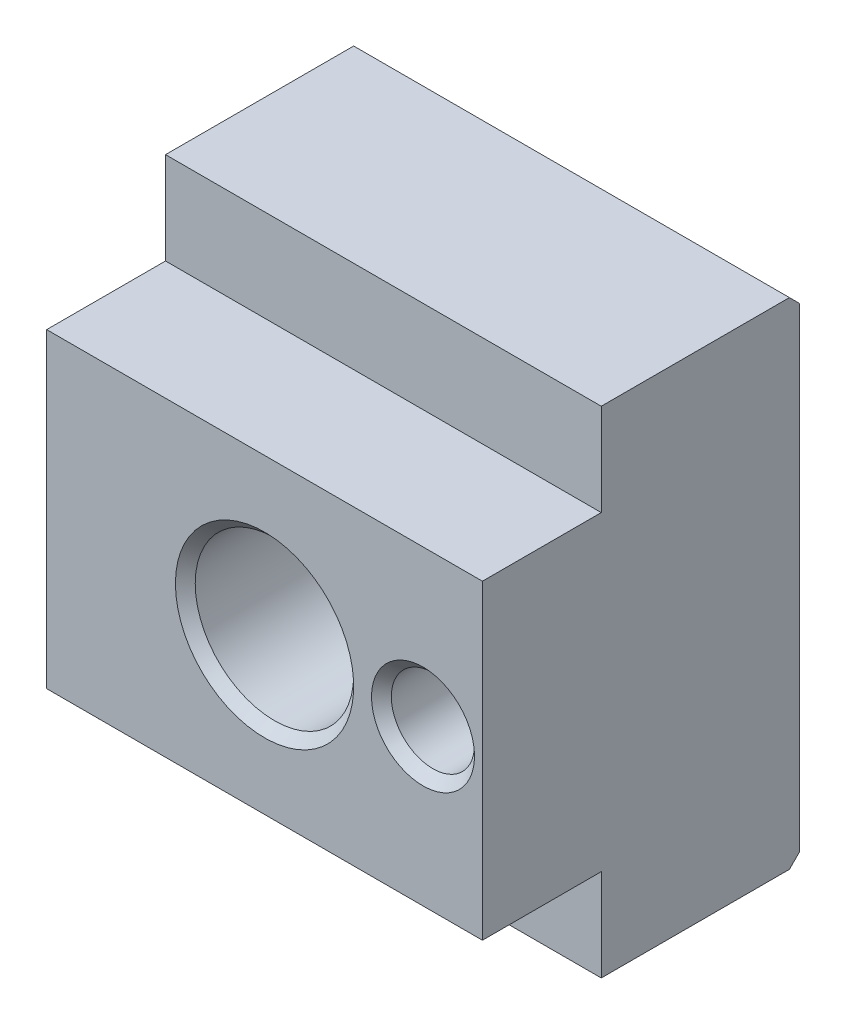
ISO-10303-21;
HEADER;
FILE_DESCRIPTION(('STEP AP214'),'2;1');
FILE_NAME('part.step','',(''),(''),'','','');
FILE_SCHEMA(('AUTOMOTIVE_DESIGN { 1 0 10303 214 1 1 1 1 }'));
ENDSEC;
DATA;
#1=APPLICATION_CONTEXT('core data for automotive mechanical design processes');
#2=APPLICATION_PROTOCOL_DEFINITION('international standard','automotive_design',2000,#1);
#3=PRODUCT_CONTEXT('',#1,'mechanical');
#4=PRODUCT('Part','Part','',(#3));
#5=PRODUCT_RELATED_PRODUCT_CATEGORY('part','',(#4));
#6=PRODUCT_DEFINITION_FORMATION('','',#4);
#7=PRODUCT_DEFINITION_CONTEXT('part definition',#1,'design');
#8=PRODUCT_DEFINITION('design','',#6,#7);
#9=PRODUCT_DEFINITION_SHAPE('','',#8);
#10=(LENGTH_UNIT() NAMED_UNIT(*) SI_UNIT(.MILLI.,.METRE.));
#11=(NAMED_UNIT(*) PLANE_ANGLE_UNIT() SI_UNIT($,.RADIAN.));
#12=(NAMED_UNIT(*) SI_UNIT($,.STERADIAN.) SOLID_ANGLE_UNIT());
#13=UNCERTAINTY_MEASURE_WITH_UNIT(LENGTH_MEASURE(1.E-05),#10,'distance_accuracy_value','');
#14=(GEOMETRIC_REPRESENTATION_CONTEXT(3) GLOBAL_UNCERTAINTY_ASSIGNED_CONTEXT((#13)) GLOBAL_UNIT_ASSIGNED_CONTEXT((#10,
#11,#12)) REPRESENTATION_CONTEXT('',''));
#15=CARTESIAN_POINT('',(0.,0.,0.));
#16=DIRECTION('',(0.,0.,1.));
#17=DIRECTION('',(1.,0.,0.));
#18=AXIS2_PLACEMENT_3D('',#15,#16,#17);
#19=CARTESIAN_POINT('',(-11.05,-7.85,0.));
#20=DIRECTION('',(0.,0.,-1.));
#21=DIRECTION('',(-1.,0.,0.));
#22=AXIS2_PLACEMENT_3D('',#19,#20,#21);
#23=PLANE('',#22);
#24=DIRECTION('',(-1.,0.,0.));
#25=VECTOR('',#24,1.);
#26=CARTESIAN_POINT('',(-11.05,-12.5,0.));
#27=LINE('',#26,#25);
#28=CARTESIAN_POINT('',(-11.,-12.5,0.));
#29=VERTEX_POINT('',#28);
#30=CARTESIAN_POINT('',(11.,-12.5,0.));
#31=VERTEX_POINT('',#30);
#32=EDGE_CURVE('E211',#29,#31,#27,.F.);
#33=ORIENTED_EDGE('',*,*,#32,.T.);
#34=DIRECTION('',(0.,1.,0.));
#35=VECTOR('',#34,1.);
#36=CARTESIAN_POINT('',(11.,-7.85,0.));
#37=LINE('',#36,#35);
#38=CARTESIAN_POINT('',(11.,-7.85,0.));
#39=VERTEX_POINT('',#38);
#40=EDGE_CURVE('E212',#31,#39,#37,.T.);
#41=ORIENTED_EDGE('',*,*,#40,.T.);
#42=DIRECTION('',(1.,0.,0.));
#43=VECTOR('',#42,1.);
#44=CARTESIAN_POINT('',(-11.05,-7.85,0.));
#45=LINE('',#44,#43);
#46=CARTESIAN_POINT('',(-11.,-7.85,0.));
#47=VERTEX_POINT('',#46);
#48=EDGE_CURVE('E120',#39,#47,#45,.F.);
#49=ORIENTED_EDGE('',*,*,#48,.T.);
#50=DIRECTION('',(0.,-1.,0.));
#51=VECTOR('',#50,1.);
#52=CARTESIAN_POINT('',(-11.,-7.85,0.));
#53=LINE('',#52,#51);
#54=EDGE_CURVE('E215',#47,#29,#53,.T.);
#55=ORIENTED_EDGE('',*,*,#54,.T.);
#56=EDGE_LOOP('',(#33,#41,#49,#55));
#57=FACE_BOUND('',#56,.T.);
#58=ADVANCED_FACE('F14',(#57),#23,.F.);
#59=CARTESIAN_POINT('',(-11.05,-7.85,6.));
#60=DIRECTION('',(0.,1.,0.));
#61=DIRECTION('',(1.,0.,0.));
#62=AXIS2_PLACEMENT_3D('',#59,#60,#61);
#63=PLANE('',#62);
#64=ORIENTED_EDGE('',*,*,#48,.F.);
#65=DIRECTION('',(0.,0.,1.));
#66=VECTOR('',#65,1.);
#67=CARTESIAN_POINT('',(11.,-7.85,6.));
#68=LINE('',#67,#66);
#69=CARTESIAN_POINT('',(11.,-7.85,6.));
#70=VERTEX_POINT('',#69);
#71=EDGE_CURVE('E253',#39,#70,#68,.T.);
#72=ORIENTED_EDGE('',*,*,#71,.T.);
#73=DIRECTION('',(-1.,0.,0.));
#74=VECTOR('',#73,1.);
#75=CARTESIAN_POINT('',(-11.05,-7.85,6.));
#76=LINE('',#75,#74);
#77=CARTESIAN_POINT('',(-11.,-7.85,6.));
#78=VERTEX_POINT('',#77);
#79=EDGE_CURVE('E109',#70,#78,#76,.T.);
#80=ORIENTED_EDGE('',*,*,#79,.T.);
#81=DIRECTION('',(0.,0.,-1.));
#82=VECTOR('',#81,1.);
#83=CARTESIAN_POINT('',(-11.,-7.85,6.));
#84=LINE('',#83,#82);
#85=EDGE_CURVE('E237',#78,#47,#84,.T.);
#86=ORIENTED_EDGE('',*,*,#85,.T.);
#87=EDGE_LOOP('',(#64,#72,#80,#86));
#88=FACE_BOUND('',#87,.T.);
#89=ADVANCED_FACE('F197',(#88),#63,.F.);
#90=CARTESIAN_POINT('',(-11.05,-7.85,6.));
#91=DIRECTION('',(0.,0.,-1.));
#92=DIRECTION('',(-1.,0.,0.));
#93=AXIS2_PLACEMENT_3D('',#90,#91,#92);
#94=PLANE('',#93);
#95=CARTESIAN_POINT('',(0.,0.,6.));
#96=DIRECTION('',(0.,0.,-1.));
#97=DIRECTION('',(-1.,0.,0.));
#98=AXIS2_PLACEMENT_3D('',#95,#96,#97);
#99=CIRCLE('',#98,4.5);
#100=CARTESIAN_POINT('',(-4.5,0.,6.));
#101=VERTEX_POINT('',#100);
#102=EDGE_CURVE('E140',#101,#101,#99,.T.);
#103=ORIENTED_EDGE('',*,*,#102,.T.);
#104=EDGE_LOOP('',(#103));
#105=FACE_BOUND('',#104,.T.);
#106=CARTESIAN_POINT('',(8.,0.,6.));
#107=DIRECTION('',(0.,0.,-1.));
#108=DIRECTION('',(-1.,0.,0.));
#109=AXIS2_PLACEMENT_3D('',#106,#107,#108);
#110=CIRCLE('',#109,2.6);
#111=CARTESIAN_POINT('',(5.4,0.,6.));
#112=VERTEX_POINT('',#111);
#113=EDGE_CURVE('E137',#112,#112,#110,.T.);
#114=ORIENTED_EDGE('',*,*,#113,.T.);
#115=EDGE_LOOP('',(#114));
#116=FACE_BOUND('',#115,.T.);
#117=ORIENTED_EDGE('',*,*,#79,.F.);
#118=DIRECTION('',(0.,-1.,0.));
#119=VECTOR('',#118,1.);
#120=CARTESIAN_POINT('',(11.,-14.2792774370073,6.));
#121=LINE('',#120,#119);
#122=CARTESIAN_POINT('',(11.,7.85,6.));
#123=VERTEX_POINT('',#122);
#124=EDGE_CURVE('E94',#123,#70,#121,.T.);
#125=ORIENTED_EDGE('',*,*,#124,.F.);
#126=DIRECTION('',(-1.,0.,0.));
#127=VECTOR('',#126,1.);
#128=CARTESIAN_POINT('',(-11.05,7.85,6.));
#129=LINE('',#128,#127);
#130=CARTESIAN_POINT('',(-11.,7.85,6.));
#131=VERTEX_POINT('',#130);
#132=EDGE_CURVE('E107',#123,#131,#129,.T.);
#133=ORIENTED_EDGE('',*,*,#132,.T.);
#134=DIRECTION('',(0.,1.,0.));
#135=VECTOR('',#134,1.);
#136=CARTESIAN_POINT('',(-11.,-14.2792774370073,6.));
#137=LINE('',#136,#135);
#138=EDGE_CURVE('E101',#78,#131,#137,.T.);
#139=ORIENTED_EDGE('',*,*,#138,.F.);
#140=EDGE_LOOP('',(#117,#125,#133,#139));
#141=FACE_BOUND('',#140,.T.);
#142=ADVANCED_FACE('F105',(#105,#116,#141),#94,.F.);
#143=CARTESIAN_POINT('',(-11.05,7.85,6.));
#144=DIRECTION('',(0.,-1.,0.));
#145=DIRECTION('',(-1.,0.,0.));
#146=AXIS2_PLACEMENT_3D('',#143,#144,#145);
#147=PLANE('',#146);
#148=ORIENTED_EDGE('',*,*,#132,.F.);
#149=DIRECTION('',(0.,0.,-1.));
#150=VECTOR('',#149,1.);
#151=CARTESIAN_POINT('',(11.,7.85,6.));
#152=LINE('',#151,#150);
#153=CARTESIAN_POINT('',(11.,7.85,0.));
#154=VERTEX_POINT('',#153);
#155=EDGE_CURVE('E91',#123,#154,#152,.T.);
#156=ORIENTED_EDGE('',*,*,#155,.T.);
#157=DIRECTION('',(-1.,0.,0.));
#158=VECTOR('',#157,1.);
#159=CARTESIAN_POINT('',(-11.05,7.85,0.));
#160=LINE('',#159,#158);
#161=CARTESIAN_POINT('',(-11.,7.85,0.));
#162=VERTEX_POINT('',#161);
#163=EDGE_CURVE('E116',#154,#162,#160,.T.);
#164=ORIENTED_EDGE('',*,*,#163,.T.);
#165=DIRECTION('',(0.,0.,1.));
#166=VECTOR('',#165,1.);
#167=CARTESIAN_POINT('',(-11.,7.85,6.));
#168=LINE('',#167,#166);
#169=EDGE_CURVE('E115',#162,#131,#168,.T.);
#170=ORIENTED_EDGE('',*,*,#169,.T.);
#171=EDGE_LOOP('',(#148,#156,#164,#170));
#172=FACE_BOUND('',#171,.T.);
#173=ADVANCED_FACE('F113',(#172),#147,.F.);
#174=CARTESIAN_POINT('',(-11.05,12.5,0.));
#175=DIRECTION('',(0.,0.,-1.));
#176=DIRECTION('',(0.,-1.,0.));
#177=AXIS2_PLACEMENT_3D('',#174,#175,#176);
#178=PLANE('',#177);
#179=ORIENTED_EDGE('',*,*,#163,.F.);
#180=DIRECTION('',(0.,1.,0.));
#181=VECTOR('',#180,1.);
#182=CARTESIAN_POINT('',(11.,12.5,0.));
#183=LINE('',#182,#181);
#184=CARTESIAN_POINT('',(11.,12.5,0.));
#185=VERTEX_POINT('',#184);
#186=EDGE_CURVE('E97',#154,#185,#183,.T.);
#187=ORIENTED_EDGE('',*,*,#186,.T.);
#188=DIRECTION('',(-1.,0.,0.));
#189=VECTOR('',#188,1.);
#190=CARTESIAN_POINT('',(-11.05,12.5,0.));
#191=LINE('',#190,#189);
#192=CARTESIAN_POINT('',(-11.,12.5,0.));
#193=VERTEX_POINT('',#192);
#194=EDGE_CURVE('E118',#185,#193,#191,.T.);
#195=ORIENTED_EDGE('',*,*,#194,.T.);
#196=DIRECTION('',(0.,-1.,0.));
#197=VECTOR('',#196,1.);
#198=CARTESIAN_POINT('',(-11.,12.5,0.));
#199=LINE('',#198,#197);
#200=EDGE_CURVE('E229',#193,#162,#199,.T.);
#201=ORIENTED_EDGE('',*,*,#200,.T.);
#202=EDGE_LOOP('',(#179,#187,#195,#201));
#203=FACE_BOUND('',#202,.T.);
#204=ADVANCED_FACE('F188',(#203),#178,.F.);
#205=CARTESIAN_POINT('',(-11.05,12.5,0.));
#206=DIRECTION('',(0.,-1.,0.));
#207=DIRECTION('',(-1.,0.,0.));
#208=AXIS2_PLACEMENT_3D('',#205,#206,#207);
#209=PLANE('',#208);
#210=ORIENTED_EDGE('',*,*,#194,.F.);
#211=DIRECTION('',(0.,0.,-1.));
#212=VECTOR('',#211,1.);
#213=CARTESIAN_POINT('',(11.,12.5,0.));
#214=LINE('',#213,#212);
#215=CARTESIAN_POINT('',(11.,12.5,-9.5));
#216=VERTEX_POINT('',#215);
#217=EDGE_CURVE('E248',#185,#216,#214,.T.);
#218=ORIENTED_EDGE('',*,*,#217,.T.);
#219=DIRECTION('',(-1.,0.,0.));
#220=VECTOR('',#219,1.);
#221=CARTESIAN_POINT('',(-11.05,12.5,-9.5));
#222=LINE('',#221,#220);
#223=CARTESIAN_POINT('',(-11.,12.5,-9.5));
#224=VERTEX_POINT('',#223);
#225=EDGE_CURVE('E218',#216,#224,#222,.T.);
#226=ORIENTED_EDGE('',*,*,#225,.T.);
#227=DIRECTION('',(0.,0.,1.));
#228=VECTOR('',#227,1.);
#229=CARTESIAN_POINT('',(-11.,12.5,0.));
#230=LINE('',#229,#228);
#231=EDGE_CURVE('E232',#224,#193,#230,.T.);
#232=ORIENTED_EDGE('',*,*,#231,.T.);
#233=EDGE_LOOP('',(#210,#218,#226,#232));
#234=FACE_BOUND('',#233,.T.);
#235=ADVANCED_FACE('F184',(#234),#209,.F.);
#236=CARTESIAN_POINT('',(-11.05,-12.5,0.));
#237=DIRECTION('',(0.,1.,0.));
#238=DIRECTION('',(0.,0.,-1.));
#239=AXIS2_PLACEMENT_3D('',#236,#237,#238);
#240=PLANE('',#239);
#241=DIRECTION('',(-1.,0.,0.));
#242=VECTOR('',#241,1.);
#243=CARTESIAN_POINT('',(-11.05,-12.5,-9.5));
#244=LINE('',#243,#242);
#245=CARTESIAN_POINT('',(-11.,-12.5,-9.5));
#246=VERTEX_POINT('',#245);
#247=CARTESIAN_POINT('',(11.,-12.5,-9.5));
#248=VERTEX_POINT('',#247);
#249=EDGE_CURVE('E220',#246,#248,#244,.F.);
#250=ORIENTED_EDGE('',*,*,#249,.T.);
#251=DIRECTION('',(0.,0.,1.));
#252=VECTOR('',#251,1.);
#253=CARTESIAN_POINT('',(11.,-12.5,0.));
#254=LINE('',#253,#252);
#255=EDGE_CURVE('E256',#248,#31,#254,.T.);
#256=ORIENTED_EDGE('',*,*,#255,.T.);
#257=ORIENTED_EDGE('',*,*,#32,.F.);
#258=DIRECTION('',(0.,0.,-1.));
#259=VECTOR('',#258,1.);
#260=CARTESIAN_POINT('',(-11.,-12.5,0.));
#261=LINE('',#260,#259);
#262=EDGE_CURVE('E241',#29,#246,#261,.T.);
#263=ORIENTED_EDGE('',*,*,#262,.T.);
#264=EDGE_LOOP('',(#250,#256,#257,#263));
#265=FACE_BOUND('',#264,.T.);
#266=ADVANCED_FACE('F181',(#265),#240,.F.);
#267=CARTESIAN_POINT('',(-11.05,12.,-10.));
#268=DIRECTION('',(0.,-0.707106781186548,0.707106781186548));
#269=DIRECTION('',(0.,0.707106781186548,0.707106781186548));
#270=AXIS2_PLACEMENT_3D('',#267,#268,#269);
#271=PLANE('',#270);
#272=ORIENTED_EDGE('',*,*,#225,.F.);
#273=DIRECTION('',(0.,-0.707106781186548,-0.707106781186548));
#274=VECTOR('',#273,1.);
#275=CARTESIAN_POINT('',(11.,12.,-10.));
#276=LINE('',#275,#274);
#277=CARTESIAN_POINT('',(11.,12.,-10.));
#278=VERTEX_POINT('',#277);
#279=EDGE_CURVE('E251',#216,#278,#276,.T.);
#280=ORIENTED_EDGE('',*,*,#279,.T.);
#281=DIRECTION('',(1.,0.,0.));
#282=VECTOR('',#281,1.);
#283=CARTESIAN_POINT('',(-11.05,12.,-10.));
#284=LINE('',#283,#282);
#285=CARTESIAN_POINT('',(-11.,12.,-10.));
#286=VERTEX_POINT('',#285);
#287=EDGE_CURVE('E37',#278,#286,#284,.F.);
#288=ORIENTED_EDGE('',*,*,#287,.T.);
#289=DIRECTION('',(0.,0.707106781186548,0.707106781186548));
#290=VECTOR('',#289,1.);
#291=CARTESIAN_POINT('',(-11.,12.,-10.));
#292=LINE('',#291,#290);
#293=EDGE_CURVE('E235',#286,#224,#292,.T.);
#294=ORIENTED_EDGE('',*,*,#293,.T.);
#295=EDGE_LOOP('',(#272,#280,#288,#294));
#296=FACE_BOUND('',#295,.T.);
#297=ADVANCED_FACE('F174',(#296),#271,.F.);
#298=CARTESIAN_POINT('',(-11.05,-12.5,-9.5));
#299=DIRECTION('',(0.,0.707106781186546,0.707106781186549));
#300=DIRECTION('',(0.,0.707106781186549,-0.707106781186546));
#301=AXIS2_PLACEMENT_3D('',#298,#299,#300);
#302=PLANE('',#301);
#303=DIRECTION('',(1.,0.,0.));
#304=VECTOR('',#303,1.);
#305=CARTESIAN_POINT('',(-11.05,-12.,-10.));
#306=LINE('',#305,#304);
#307=CARTESIAN_POINT('',(-11.,-12.,-10.));
#308=VERTEX_POINT('',#307);
#309=CARTESIAN_POINT('',(11.,-12.,-10.));
#310=VERTEX_POINT('',#309);
#311=EDGE_CURVE('E129',#308,#310,#306,.T.);
#312=ORIENTED_EDGE('',*,*,#311,.T.);
#313=DIRECTION('',(0.,-0.707106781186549,0.707106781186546));
#314=VECTOR('',#313,1.);
#315=CARTESIAN_POINT('',(11.,-12.5,-9.5));
#316=LINE('',#315,#314);
#317=EDGE_CURVE('E29',#310,#248,#316,.T.);
#318=ORIENTED_EDGE('',*,*,#317,.T.);
#319=ORIENTED_EDGE('',*,*,#249,.F.);
#320=DIRECTION('',(0.,0.707106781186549,-0.707106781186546));
#321=VECTOR('',#320,1.);
#322=CARTESIAN_POINT('',(-11.,-12.5,-9.5));
#323=LINE('',#322,#321);
#324=EDGE_CURVE('E243',#246,#308,#323,.T.);
#325=ORIENTED_EDGE('',*,*,#324,.T.);
#326=EDGE_LOOP('',(#312,#318,#319,#325));
#327=FACE_BOUND('',#326,.T.);
#328=ADVANCED_FACE('F165',(#327),#302,.F.);
#329=CARTESIAN_POINT('',(-11.05,12.5,-10.));
#330=DIRECTION('',(0.,0.,1.));
#331=DIRECTION('',(1.,0.,0.));
#332=AXIS2_PLACEMENT_3D('',#329,#330,#331);
#333=PLANE('',#332);
#334=CARTESIAN_POINT('',(0.,0.,-10.));
#335=DIRECTION('',(0.,0.,1.));
#336=DIRECTION('',(1.,0.,0.));
#337=AXIS2_PLACEMENT_3D('',#334,#335,#336);
#338=CIRCLE('',#337,4.5);
#339=CARTESIAN_POINT('',(4.5,0.,-10.));
#340=VERTEX_POINT('',#339);
#341=EDGE_CURVE('E22',#340,#340,#338,.T.);
#342=ORIENTED_EDGE('',*,*,#341,.T.);
#343=EDGE_LOOP('',(#342));
#344=FACE_BOUND('',#343,.T.);
#345=ORIENTED_EDGE('',*,*,#287,.F.);
#346=DIRECTION('',(0.,-1.,0.));
#347=VECTOR('',#346,1.);
#348=CARTESIAN_POINT('',(11.,12.5,-10.));
#349=LINE('',#348,#347);
#350=EDGE_CURVE('E128',#278,#310,#349,.T.);
#351=ORIENTED_EDGE('',*,*,#350,.T.);
#352=ORIENTED_EDGE('',*,*,#311,.F.);
#353=DIRECTION('',(0.,1.,0.));
#354=VECTOR('',#353,1.);
#355=CARTESIAN_POINT('',(-11.,12.5,-10.));
#356=LINE('',#355,#354);
#357=EDGE_CURVE('E125',#308,#286,#356,.T.);
#358=ORIENTED_EDGE('',*,*,#357,.T.);
#359=EDGE_LOOP('',(#345,#351,#352,#358));
#360=FACE_BOUND('',#359,.T.);
#361=ADVANCED_FACE('F145',(#344,#360),#333,.F.);
#362=CARTESIAN_POINT('',(-11.,-14.2792774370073,-10.));
#363=DIRECTION('',(1.,0.,0.));
#364=DIRECTION('',(0.,-1.,0.));
#365=AXIS2_PLACEMENT_3D('',#362,#363,#364);
#366=PLANE('',#365);
#367=ORIENTED_EDGE('',*,*,#200,.F.);
#368=ORIENTED_EDGE('',*,*,#231,.F.);
#369=ORIENTED_EDGE('',*,*,#293,.F.);
#370=ORIENTED_EDGE('',*,*,#357,.F.);
#371=ORIENTED_EDGE('',*,*,#324,.F.);
#372=ORIENTED_EDGE('',*,*,#262,.F.);
#373=ORIENTED_EDGE('',*,*,#54,.F.);
#374=ORIENTED_EDGE('',*,*,#85,.F.);
#375=ORIENTED_EDGE('',*,*,#138,.T.);
#376=ORIENTED_EDGE('',*,*,#169,.F.);
#377=EDGE_LOOP('',(#367,#368,#369,#370,#371,#372,#373,#374,#375,#376));
#378=FACE_BOUND('',#377,.T.);
#379=ADVANCED_FACE('F164',(#378),#366,.F.);
#380=CARTESIAN_POINT('',(11.,-14.2792774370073,-10.));
#381=DIRECTION('',(-1.,0.,0.));
#382=DIRECTION('',(0.,1.,0.));
#383=AXIS2_PLACEMENT_3D('',#380,#381,#382);
#384=PLANE('',#383);
#385=ORIENTED_EDGE('',*,*,#124,.T.);
#386=ORIENTED_EDGE('',*,*,#71,.F.);
#387=ORIENTED_EDGE('',*,*,#40,.F.);
#388=ORIENTED_EDGE('',*,*,#255,.F.);
#389=ORIENTED_EDGE('',*,*,#317,.F.);
#390=ORIENTED_EDGE('',*,*,#350,.F.);
#391=ORIENTED_EDGE('',*,*,#279,.F.);
#392=ORIENTED_EDGE('',*,*,#217,.F.);
#393=ORIENTED_EDGE('',*,*,#186,.F.);
#394=ORIENTED_EDGE('',*,*,#155,.F.);
#395=EDGE_LOOP('',(#385,#386,#387,#388,#389,#390,#391,#392,#393,#394));
#396=FACE_BOUND('',#395,.T.);
#397=ADVANCED_FACE('F93',(#396),#384,.F.);
#398=CARTESIAN_POINT('',(0.,0.,-10.));
#399=DIRECTION('',(0.,0.,1.));
#400=DIRECTION('',(1.,0.,0.));
#401=AXIS2_PLACEMENT_3D('',#398,#399,#400);
#402=CYLINDRICAL_SURFACE('',#401,4.);
#403=CARTESIAN_POINT('',(0.,0.,5.5));
#404=DIRECTION('',(0.,0.,-1.));
#405=DIRECTION('',(-1.,0.,0.));
#406=AXIS2_PLACEMENT_3D('',#403,#404,#405);
#407=CIRCLE('',#406,4.);
#408=CARTESIAN_POINT('',(-4.,0.,5.5));
#409=VERTEX_POINT('',#408);
#410=EDGE_CURVE('E134',#409,#409,#407,.F.);
#411=ORIENTED_EDGE('',*,*,#410,.T.);
#412=EDGE_LOOP('',(#411));
#413=FACE_BOUND('',#412,.T.);
#414=CARTESIAN_POINT('',(0.,0.,-9.5));
#415=DIRECTION('',(0.,0.,1.));
#416=DIRECTION('',(1.,0.,0.));
#417=AXIS2_PLACEMENT_3D('',#414,#415,#416);
#418=CIRCLE('',#417,4.);
#419=CARTESIAN_POINT('',(4.,0.,-9.5));
#420=VERTEX_POINT('',#419);
#421=EDGE_CURVE('E131',#420,#420,#418,.F.);
#422=ORIENTED_EDGE('',*,*,#421,.T.);
#423=EDGE_LOOP('',(#422));
#424=FACE_BOUND('',#423,.T.);
#425=ADVANCED_FACE('F265',(#413,#424),#402,.F.);
#426=CARTESIAN_POINT('',(8.,0.,-6.));
#427=DIRECTION('',(0.,0.,1.));
#428=DIRECTION('',(1.,0.,0.));
#429=AXIS2_PLACEMENT_3D('',#426,#427,#428);
#430=CYLINDRICAL_SURFACE('',#429,2.1);
#431=CARTESIAN_POINT('',(8.,0.,5.5));
#432=DIRECTION('',(0.,0.,-1.));
#433=DIRECTION('',(-1.,0.,0.));
#434=AXIS2_PLACEMENT_3D('',#431,#432,#433);
#435=CIRCLE('',#434,2.1);
#436=CARTESIAN_POINT('',(5.9,0.,5.5));
#437=VERTEX_POINT('',#436);
#438=EDGE_CURVE('E9',#437,#437,#435,.F.);
#439=ORIENTED_EDGE('',*,*,#438,.T.);
#440=EDGE_LOOP('',(#439));
#441=FACE_BOUND('',#440,.T.);
#442=CARTESIAN_POINT('',(8.,0.,-6.));
#443=DIRECTION('',(0.,0.,1.));
#444=DIRECTION('',(1.,0.,0.));
#445=AXIS2_PLACEMENT_3D('',#442,#443,#444);
#446=CIRCLE('',#445,2.1);
#447=CARTESIAN_POINT('',(10.1,0.,-6.));
#448=VERTEX_POINT('',#447);
#449=EDGE_CURVE('E110',#448,#448,#446,.T.);
#450=ORIENTED_EDGE('',*,*,#449,.F.);
#451=EDGE_LOOP('',(#450));
#452=FACE_BOUND('',#451,.T.);
#453=ADVANCED_FACE('F263',(#441,#452),#430,.F.);
#454=CARTESIAN_POINT('',(8.,0.,-6.));
#455=DIRECTION('',(0.,0.,1.));
#456=DIRECTION('',(1.,0.,0.));
#457=AXIS2_PLACEMENT_3D('',#454,#455,#456);
#458=PLANE('',#457);
#459=ORIENTED_EDGE('',*,*,#449,.T.);
#460=EDGE_LOOP('',(#459));
#461=FACE_BOUND('',#460,.T.);
#462=ADVANCED_FACE('F159',(#461),#458,.T.);
#463=CARTESIAN_POINT('',(0.,0.,5.5));
#464=DIRECTION('',(0.,0.,1.));
#465=DIRECTION('',(1.,0.,0.));
#466=AXIS2_PLACEMENT_3D('',#463,#464,#465);
#467=CONICAL_SURFACE('',#466,4.,0.78539816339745);
#468=ORIENTED_EDGE('',*,*,#102,.F.);
#469=EDGE_LOOP('',(#468));
#470=FACE_BOUND('',#469,.T.);
#471=ORIENTED_EDGE('',*,*,#410,.F.);
#472=EDGE_LOOP('',(#471));
#473=FACE_BOUND('',#472,.T.);
#474=ADVANCED_FACE('F150',(#470,#473),#467,.F.);
#475=CARTESIAN_POINT('',(0.,0.,-10.));
#476=DIRECTION('',(0.,0.,-1.));
#477=DIRECTION('',(-1.,0.,0.));
#478=AXIS2_PLACEMENT_3D('',#475,#476,#477);
#479=CONICAL_SURFACE('',#478,4.5,0.785398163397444);
#480=ORIENTED_EDGE('',*,*,#421,.F.);
#481=EDGE_LOOP('',(#480));
#482=FACE_BOUND('',#481,.T.);
#483=ORIENTED_EDGE('',*,*,#341,.F.);
#484=EDGE_LOOP('',(#483));
#485=FACE_BOUND('',#484,.T.);
#486=ADVANCED_FACE('F148',(#482,#485),#479,.F.);
#487=CARTESIAN_POINT('',(8.,0.,5.5));
#488=DIRECTION('',(0.,0.,1.));
#489=DIRECTION('',(1.,0.,0.));
#490=AXIS2_PLACEMENT_3D('',#487,#488,#489);
#491=CONICAL_SURFACE('',#490,2.1,0.785398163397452);
#492=ORIENTED_EDGE('',*,*,#113,.F.);
#493=EDGE_LOOP('',(#492));
#494=FACE_BOUND('',#493,.T.);
#495=ORIENTED_EDGE('',*,*,#438,.F.);
#496=EDGE_LOOP('',(#495));
#497=FACE_BOUND('',#496,.T.);
#498=ADVANCED_FACE('F16',(#494,#497),#491,.F.);
#499=CLOSED_SHELL('',(#58,#89,#142,#173,#204,#235,#266,#297,#328,#361,#379,#397,#425,#453,#462,
#474,#486,#498));
#500=MANIFOLD_SOLID_BREP('B1',#499);
#501=ADVANCED_BREP_SHAPE_REPRESENTATION('',(#18,#500),#14);
#502=SHAPE_DEFINITION_REPRESENTATION(#9,#501);
ENDSEC;
END-ISO-10303-21;
